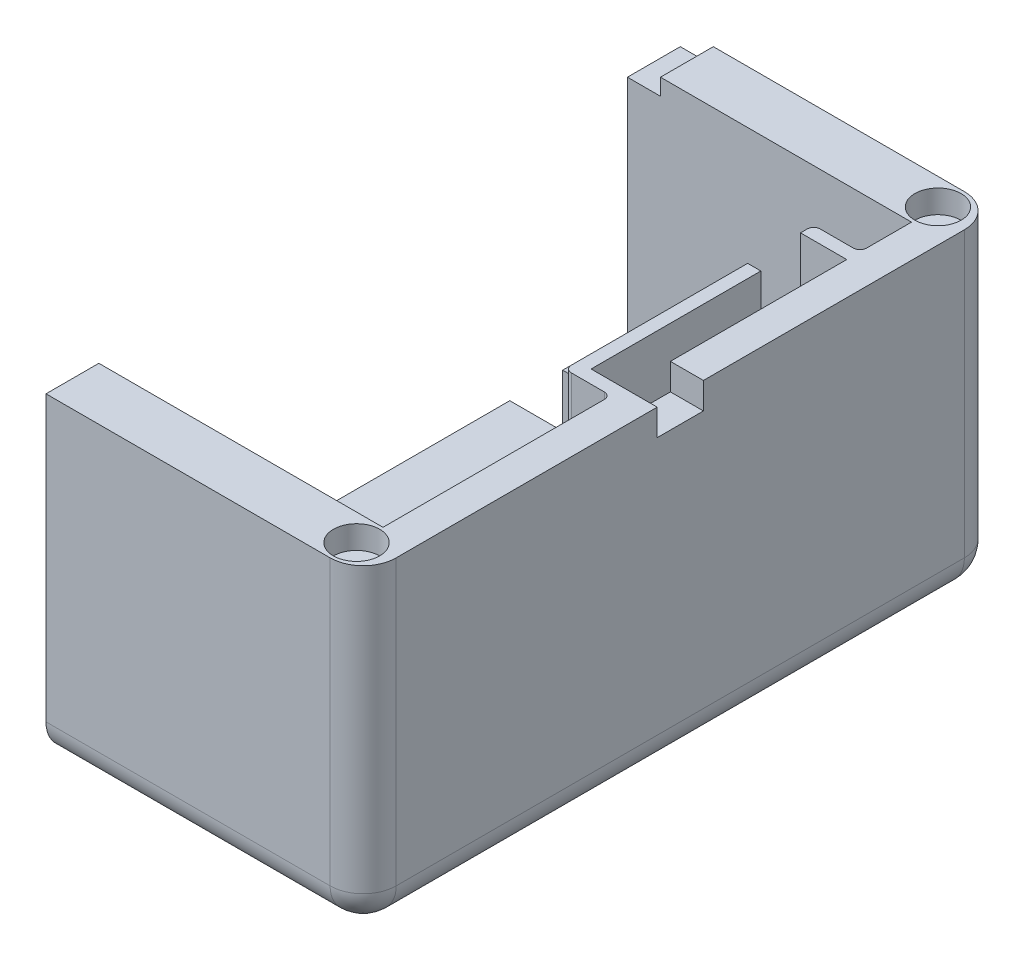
from build123d import *

# Parameters (mm, degrees)
SKETCH1_W                = 48
SKETCH1_H                = 48
BOSS_EXTRUDE1_DEPTH      = 8
BOSS_EXTRUDE2_DEPTH      = 80
SKETCH3_W                = 48
SKETCH3_H                = 48
BOSS_EXTRUDE3_DEPTH      = 8
FILLET1_R                = 5
SKETCH4_W                = 7
SKETCH4_H                = 4
CUT_EXTRUDE1_DEPTH       = 10
BOSS_EXTRUDE4_DEPTH      = 7
SKETCH6_W                = 2
SKETCH6_H                = 33.69370628
BOSS_EXTRUDE5_DEPTH      = 9
SKETCH8_W                = 8
SKETCH8_H                = 9
CUT_EXTRUDE2_DEPTH       = 5
SKETCH12_R               = 3.5
CUT_EXTRUDE9_DEPTH       = 3.5
MIRROR3_COPY_1_SKETCH_R  = 3.5
MIRROR3_COPY_1_DEPTH     = 3.5
SKETCH13_W               = 5
SKETCH13_H               = 2.5
CUT_EXTRUDE10_DEPTH      = 10
SKETCH15_R               = 1.59
BOSS_EXTRUDE6_DEPTH      = 5
BOSS_EXTRUDE8_REACH      = 97.274
SKETCH19_R               = 2.5
SKETCH20_R               = 1.75
CUT_EXTRUDE13_DEPTH      = 3
BOSS_EXTRUDE7_DEPTH      = 2
BOSS_EXTRUDE7_DEPTH_BACK = 5
SKETCH16_R               = 5
SKETCH18_R               = 1.75
CUT_EXTRUDE12_DEPTH      = 3
FILLET2_R                = 1
FILLET3_R                = 1


with BuildPart() as part:
    # Sketch1 → Boss-Extrude1 (new body)
    with BuildSketch(Plane.XY):
        with Locations((1.44697784, 15.25)):
            Rectangle(SKETCH1_W, SKETCH1_H)
    extrude(amount=BOSS_EXTRUDE1_DEPTH)

    # Sketch2 → Boss-Extrude2 (add)
    with BuildSketch(Plane.XY.offset(8)):
        Polygon((-22.55302216, -8.75), (25.44697784, -8.75), (25.44697784, -3.75), (25.44697784, 39.25), (20.44697784, 39.25), (20.44697784, -3.75), (-22.55302216, -3.75), align=None)
    extrude(amount=BOSS_EXTRUDE2_DEPTH)

    # Sketch3 → Boss-Extrude3 (add)
    with BuildSketch(Plane.XY.offset(88)):
        with Locations((1.44697784, 15.25)):
            Rectangle(SKETCH3_W, SKETCH3_H)
    extrude(amount=BOSS_EXTRUDE3_DEPTH)

    # Fillet1
    fillet1_edges = [part.edges().sort_by_distance(p)[0] for p in [
        (1.44697784, -8.75, 96),
        (25.44697784, 15.25, 96),
        (25.44697784, 15.25, 0),
        (1.44697784, -8.75, 0),
        (25.44697784, -8.75, 48),
    ]]
    fillet(fillet1_edges, radius=FILLET1_R)

    # Sketch4 → Cut-Extrude1 (cut)
    with BuildSketch(Plane(origin=(25.44697784, 0, 0), x_dir=(0, 0, -1), z_dir=(1, 0, 0))):
        with Locations((-48, 37.25)):
            Rectangle(SKETCH4_W, SKETCH4_H)
    cut_extrude1 = extrude(amount=-CUT_EXTRUDE1_DEPTH, mode=Mode.SUBTRACT)

    # Sketch5 → Boss-Extrude4 (add)
    with BuildSketch(Plane.ZY.offset(-20.44697784)):
        Polygon((53.5, 39.25), (51.5, 39.25), (51.5, 35.25), (51.5, 30.25), (17.80629372, 30.25), (17.80629372, 39.25), (15.80629372, 39.25), (15.80629372, 28.25), (53.5, 28.25), align=None)
    boss_extrude4 = extrude(amount=BOSS_EXTRUDE4_DEPTH)

    # Sketch6 → Boss-Extrude5 (add)
    with BuildSketch(Plane(origin=(0, 30.25, 0), x_dir=(1, 0, 0), z_dir=(0, 1, 0))):
        with Locations((14.44697784, -34.65314686)):
            Rectangle(SKETCH6_W, SKETCH6_H)
    boss_extrude5 = extrude(amount=BOSS_EXTRUDE5_DEPTH)

    # Sketch8 → Cut-Extrude2 (cut)
    with BuildSketch(Plane.ZY.offset(-13.44697784)):
        with Locations((21.80629372, 34.75)):
            Rectangle(SKETCH8_W, SKETCH8_H)
    cut_extrude2 = extrude(amount=-CUT_EXTRUDE2_DEPTH, mode=Mode.SUBTRACT)

    # Mirror1: Cut-Extrude1, Boss-Extrude4, Boss-Extrude5, Cut-Extrude2 across plane
    add(cut_extrude1.mirror(Plane(origin=(8.34848892, 8.34848892, 0), x_dir=(0, 0, 1), z_dir=(0.7071067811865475, 0.7071067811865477, 0))), mode=Mode.SUBTRACT)
    add(boss_extrude4.mirror(Plane(origin=(8.34848892, 8.34848892, 0), x_dir=(0, 0, 1), z_dir=(0.7071067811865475, 0.7071067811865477, 0))))
    add(boss_extrude5.mirror(Plane(origin=(8.34848892, 8.34848892, 0), x_dir=(0, 0, 1), z_dir=(0.7071067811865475, 0.7071067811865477, 0))))
    add(cut_extrude2.mirror(Plane(origin=(8.34848892, 8.34848892, 0), x_dir=(0, 0, 1), z_dir=(0.7071067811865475, 0.7071067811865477, 0))), mode=Mode.SUBTRACT)

    # Sketch12 → Cut-Extrude9 (cut)
    with BuildSketch(Plane(origin=(0, 39.25, 0), x_dir=(1, 0, 0), z_dir=(0, 1, 0))):
        with Locations(Location((20.44697784, -92, 0), (0, 0, 270))):
            Circle(SKETCH12_R)
    cut_extrude9 = extrude(amount=-CUT_EXTRUDE9_DEPTH, mode=Mode.SUBTRACT)

    # Mirror2: Cut-Extrude9 across plane
    add(cut_extrude9.mirror(Plane(origin=(8.34848892, 8.34848892, 0), x_dir=(0, 0, 1), z_dir=(0.7071067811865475, 0.7071067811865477, 0))), mode=Mode.SUBTRACT)

    # Mirror3: Cut-Extrude9 across plane
    add(cut_extrude9.mirror(Plane.XY.offset(48)), mode=Mode.SUBTRACT)

    # Mirror3 copy 1 sketch → Mirror3 copy 1 (cut)
    with BuildSketch(Plane(origin=(-22.55302216, 16.69697784, 96), x_dir=(0, -1, 0), z_dir=(-1, 0, 0))):
        with Locations(Location((20.44697784, -92, 0), (0, 0, 270))):
            Circle(MIRROR3_COPY_1_SKETCH_R)
    extrude(amount=-MIRROR3_COPY_1_DEPTH, mode=Mode.SUBTRACT)

    # Sketch13 → Cut-Extrude10 (cut)
    with BuildSketch(Plane(origin=(0, 0, 0), x_dir=(-1, 0, 0), z_dir=(0, 0, -1))):
        with Locations((20.05302216, 38)):
            Rectangle(SKETCH13_W, SKETCH13_H)
    extrude(amount=-CUT_EXTRUDE10_DEPTH, mode=Mode.SUBTRACT)

    # Sketch15 → Boss-Extrude6 (add, symmetric)
    with BuildSketch(Plane(origin=(0, 0, 88), x_dir=(-1, 0, 0), z_dir=(0, 0, -1))):
        with Locations((-4.52697784, 22.91)):
            Circle(SKETCH15_R)
    extrude(amount=BOSS_EXTRUDE6_DEPTH, both=True)

    # Sketch19 → Boss-Extrude8 (add, up to next)
    with BuildSketch(Plane(origin=(0, 0, 83), x_dir=(-1, 0, 0), z_dir=(0, 0, -1)), mode=Mode.PRIVATE) as boss_extrude8_sk1:
        with Locations((-4.52697784, 22.91)):
            Circle(SKETCH19_R)
    boss_extrude8_tool1 = extrude(boss_extrude8_sk1.sketch, amount=-BOSS_EXTRUDE8_REACH, mode=Mode.PRIVATE) - part.part
    add(boss_extrude8_tool1.solids().sort_by_distance((4.526978, 22.91, 83))[0])

    # Sketch20 → Cut-Extrude13 (cut)
    with BuildSketch(Plane(origin=(0, 0, 83), x_dir=(-1, 0, 0), z_dir=(0, 0, -1))):
        with Locations((-4.52697784, 22.91)):
            Circle(SKETCH20_R)
    extrude(amount=-CUT_EXTRUDE13_DEPTH, mode=Mode.SUBTRACT)

    # Sketch16 → Boss-Extrude7 (add, two sides: drawn at the far end of the back side and taken through both)
    with BuildSketch(Plane(origin=(0, 0, 83), x_dir=(-1, 0, 0), z_dir=(0, 0, -1)).offset(-BOSS_EXTRUDE7_DEPTH_BACK)):
        with Locations((-4.52697784, 22.91)):
            Circle(SKETCH16_R)
    extrude(amount=BOSS_EXTRUDE7_DEPTH + BOSS_EXTRUDE7_DEPTH_BACK)

    # Sketch18 → Cut-Extrude12 (cut)
    with BuildSketch(Plane(origin=(0, 0, 81), x_dir=(-1, 0, 0), z_dir=(0, 0, -1))):
        with Locations((-4.52697784, 22.91)):
            Circle(SKETCH18_R)
    extrude(amount=-CUT_EXTRUDE12_DEPTH, mode=Mode.SUBTRACT)

    # Fillet2
    fillet2_edges = [part.edges().sort_by_distance(p)[0] for p in [
        (-17.05302216, 3.25, 53.5),
        (-11.55302216, -3.75, 34.65314686),
        (-11.55302216, -0.25, 53.5),
        (-17.05302216, 3.25, 15.80629372),
        (-11.55302216, -0.25, 15.80629372),
        (-11.55302216, 3.25, 34.65314686),
        (-17.05302216, -3.75, 15.80629372),
        (-17.05302216, -3.75, 53.5),
    ]]
    fillet(fillet2_edges, radius=FILLET2_R)

    # Fillet3
    fillet3_edges = [part.edges().sort_by_distance(p)[0] for p in [
        (20.44697784, 33.75, 15.80629372),
        (13.44697784, 28.25, 34.65314686),
        (16.94697784, 28.25, 15.80629372),
        (20.44697784, 33.75, 53.5),
        (13.44697784, 33.75, 15.80629372),
        (13.44697784, 33.75, 53.5),
        (20.44697784, 28.25, 34.65314686),
    ]]
    fillet(fillet3_edges, radius=FILLET3_R)


solid = part.part
